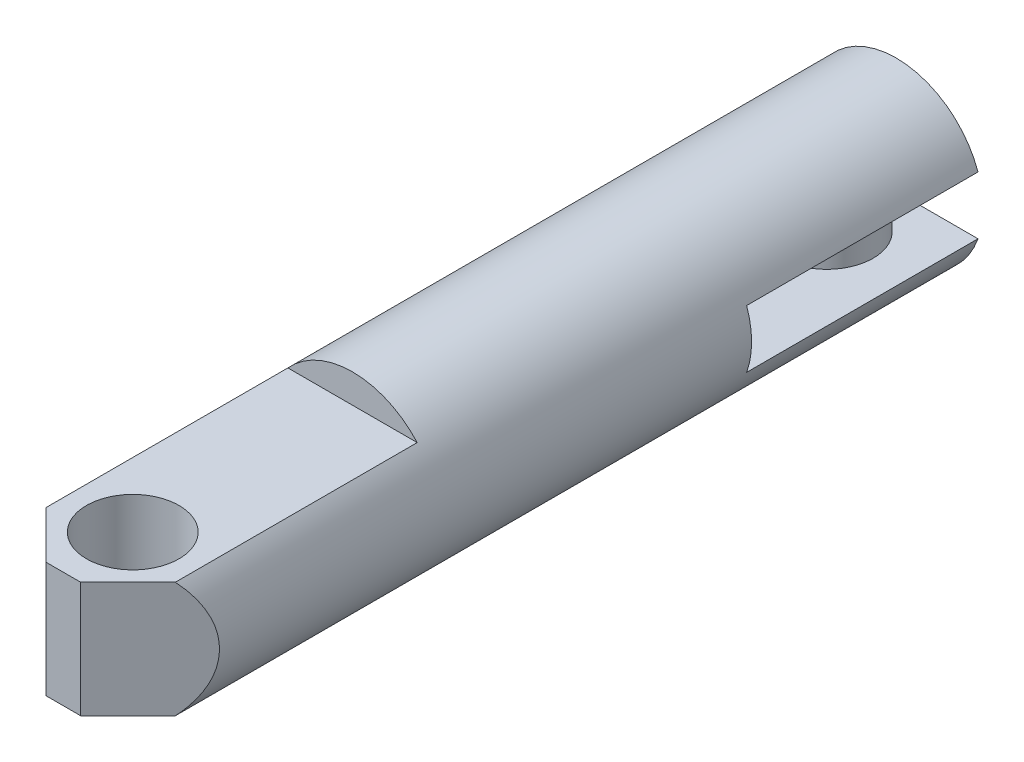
from build123d import *

# Parameters (mm, degrees)
ESQUISSE2_R             = 7.5
BASE_EXTRUSION_DEPTH    = 72
ESQUISSE3_W             = 15
ESQUISSE3_H             = 2.5
ENL_V_MAT_EXTRU_2_DEPTH = 25
ESQUISSE4_R             = 4
ENL_V_MAT_EXTRU_5_DEPTH = 74.46087394
ESQUISSE5_W             = 15
ESQUISSE5_H             = 5
ENL_V_MAT_EXTRU_4_DEPTH = 20
BOSS_EXTRU_1_REACH      = 75.077
ESQUISSE6_R             = 4
ENL_V_MAT_EXTRU_6_DEPTH = 74.46087394


with BuildPart() as part:
    # Esquisse2 → Base-Extrusion (new body)
    with BuildSketch(Plane.XY):
        Circle(ESQUISSE2_R)
    extrude(amount=BASE_EXTRUSION_DEPTH)

    # Esquisse3 → Enl_v. mat.-Extru.2 (cut)
    with BuildSketch(Plane.XY.offset(72)):
        with Locations((0, 6.25)):
            Rectangle(ESQUISSE3_W, ESQUISSE3_H)
        with Locations((0, -6.25)):
            Rectangle(ESQUISSE3_W, ESQUISSE3_H)
    extrude(amount=-ENL_V_MAT_EXTRU_2_DEPTH, mode=Mode.SUBTRACT)

    # Esquisse4 → Enl_v. mat.-Extru.5 (cut, through all)
    with BuildSketch(Plane(origin=(0, 5, 0), x_dir=(-1, 0, 0), z_dir=(0, 1, 0))):
        with Locations(Location((0, 66, 0), (0, 0, 90))):
            Circle(ESQUISSE4_R)
    extrude(amount=-ENL_V_MAT_EXTRU_5_DEPTH, mode=Mode.SUBTRACT)

    # Esquisse5 → Enl_v. mat.-Extru.4 (cut)
    with BuildSketch(Plane(origin=(0, 0, 0), x_dir=(-1, 0, 0), z_dir=(0, 0, -1))):
        Rectangle(ESQUISSE5_W, ESQUISSE5_H)
    extrude(amount=-ENL_V_MAT_EXTRU_4_DEPTH, mode=Mode.SUBTRACT)

    # Esquisse6 → Boss.-Extru.1 (add, up to next)
    with BuildSketch(Plane(origin=(0, -2.5, 0), x_dir=(-1, 0, 0), z_dir=(0, 1, 0)), mode=Mode.PRIVATE) as boss_extru_1_sk1:
        with Locations(Location((0, 6, 0), (0, 0, 270))):
            Circle(ESQUISSE6_R)
    boss_extru_1_tool1 = extrude(boss_extru_1_sk1.sketch, amount=BOSS_EXTRU_1_REACH, mode=Mode.PRIVATE) - part.part
    add(boss_extru_1_tool1.solids().sort_by_distance((0, -2.5, 6))[0])

    # Esquisse7 → Enl_v. mat.-Extru.6 (cut, through all)
    with BuildSketch(Plane(origin=(0, 5, 0), x_dir=(-1, 0, 0), z_dir=(0, 1, 0))):
        Polygon((-1.5, 72), (-7.5, 66), (-7.5, 72), align=None)
        Polygon((1.5, 72), (7.5, 72), (7.5, 66), align=None)
    extrude(amount=-ENL_V_MAT_EXTRU_6_DEPTH, mode=Mode.SUBTRACT)


solid = part.part
